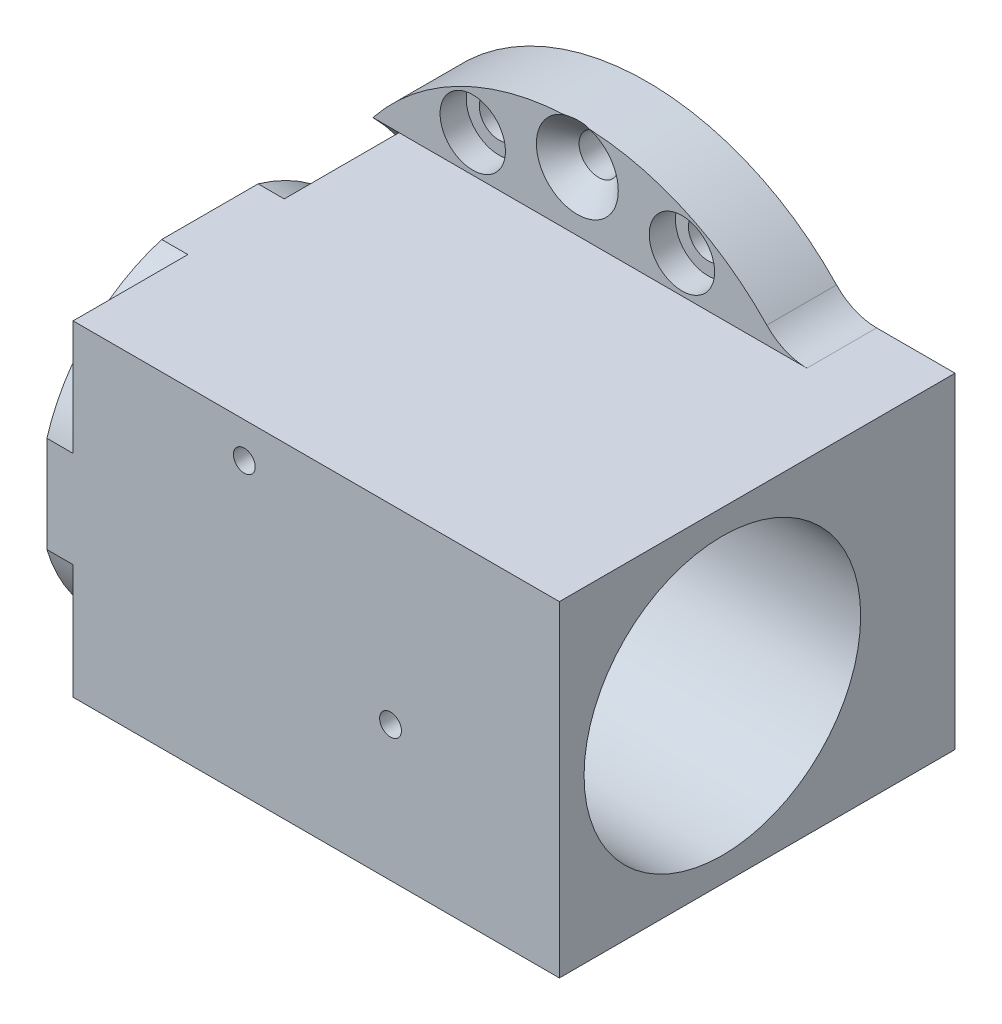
from build123d import *

# Parameters (mm, degrees)
BOSS_EXTRUDE1_DEPTH                                 = 8
CUT_EXTRUDE1_REACH                                  = 65.856
SKETCH4_W                                           = 55.8
SKETCH4_H                                           = 37.4
BOSS_EXTRUDE2_DEPTH                                 = 37.4
BOSS_EXTRUDE3_DEPTH                                 = 3
CUT_EXTRUDE2_START                                  = -3
CUT_EXTRUDE2_DEPTH                                  = 3
CUT_EXTRUDE3_START                                  = -3
CUT_EXTRUDE3_DEPTH                                  = 3
CSK_FOR_8_FLAT_HEAD_MACHINE_SCREW_100_D             = 4.5
CSK_FOR_8_FLAT_HEAD_MACHINE_SCREW_100_CSINK_D       = 9.4
CSK_FOR_8_FLAT_HEAD_MACHINE_SCREW_100_CSINK_ANGLE   = 90
F_4_CLEARANCE_HOLE1_D                               = 3.3
F_4_CLEARANCE_HOLE1_DEPTH                           = 6
CBORE_FOR_8_BINDING_HEAD_MACHINE_SCREW1_D           = 4.5
CBORE_FOR_8_BINDING_HEAD_MACHINE_SCREW1_CBORE_D     = 7.5
CBORE_FOR_8_BINDING_HEAD_MACHINE_SCREW1_CBORE_DEPTH = 3
F_2_CLEARANCE_HOLE1_D                               = 2.5
F_2_CLEARANCE_HOLE1_DEPTH                           = 6
F_2_CLEARANCE_HOLE2_REACH                           = 66.886
F_2_CLEARANCE_HOLE2_BORE_R                          = 1.25
FILLET1_R                                           = 6.35


with BuildPart() as part:
    # Sketch1 → Boss-Extrude1 (new body)
    with BuildSketch(Plane.XY.offset(8)):
        with BuildLine():
            Line((-23.45868709, 18.7), (-23.45868709, -18.7))
            ThreePointArc((-23.45868709, -18.7), (0, -30), (23.45868709, -18.7))
            Line((23.45868709, -18.7), (35.34131291, -18.7))
            Line((35.34131291, -18.7), (35.34131291, 18.7))
            Line((35.34131291, 18.7), (23.45868709, 18.7))
            ThreePointArc((23.45868709, 18.7), (0, 30), (-23.45868709, 18.7))
        make_face()
    extrude(amount=-BOSS_EXTRUDE1_DEPTH)

    # Sketch3 → Cut-Extrude1 (cut, up to next)
    with BuildSketch(Plane(origin=(-20.45868709, 0, 0), x_dir=(0, 0, -1), z_dir=(1, 0, 0)), mode=Mode.PRIVATE) as cut_extrude1_sk1:
        with BuildLine():
            Line((-8, 18.7), (-8, -18.7))
            ThreePointArc((-8, -18.7), (-0.254206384, 0), (-8, 18.7))
        make_face()
    cut_extrude1_tool1 = extrude(cut_extrude1_sk1.sketch, amount=-CUT_EXTRUDE1_REACH, mode=Mode.PRIVATE) & part.part
    add(cut_extrude1_tool1.solids().sort_by_distance((-20.458687, 0, 4.859168))[0], mode=Mode.SUBTRACT)

    # Sketch4 → Boss-Extrude2 (add)
    with BuildSketch(Plane.XY.offset(8)):
        with Locations((7.44131291, 0)):
            Rectangle(SKETCH4_W, SKETCH4_H)
    extrude(amount=BOSS_EXTRUDE2_DEPTH)

    # Sketch5 → Boss-Extrude3 (add)
    with BuildSketch(Plane.ZY.offset(20.45868709)):
        with BuildLine():
            Line((21.171890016, 18.7), (45.4, 18.7))
            Line((45.4, 18.7), (45.4, -18.7))
            Line((45.4, -18.7), (21.171890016, -18.7))
            ThreePointArc((21.171890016, -18.7), (7.2, 0), (21.171890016, 18.7))
        make_face()
    extrude(amount=BOSS_EXTRUDE3_DEPTH)

    # Sketch6 → Cut-Extrude2 (cut)
    with BuildSketch(Plane.ZY.offset(23.45868709).offset(CUT_EXTRUDE2_START)):
        with BuildLine():
            Line((45.4, -18.7), (45.4, -5.528109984))
            ThreePointArc((45.4, -5.528109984), (40.488582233, -13.788582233), (32.228109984, -18.7))
            Line((32.228109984, -18.7), (45.4, -18.7))
        make_face()
    extrude(amount=CUT_EXTRUDE2_DEPTH, mode=Mode.SUBTRACT)

    # Sketch7 → Cut-Extrude3 (cut)
    with BuildSketch(Plane.ZY.offset(23.45868709).offset(CUT_EXTRUDE3_START)):
        with BuildLine():
            Line((45.4, 18.7), (32.228109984, 18.7))
            ThreePointArc((32.228109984, 18.7), (40.488582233, 13.788582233), (45.4, 5.528109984))
            Line((45.4, 5.528109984), (45.4, 18.7))
        make_face()
    extrude(amount=CUT_EXTRUDE3_DEPTH, mode=Mode.SUBTRACT)

    # Sketch8 → Cut-Revolve1 (revolve, cut)
    with BuildSketch(Plane.XY.offset(26.7)):
        Polygon((-23.45868709, 15.86865), (-23.45868709, 0), (35.34131291, 0), (35.34131291, 15.86865), (9.94131291, 15.86865), (9.94131291, 13.5), (1.94131291, 13.5), (1.94131291, 15.86865), align=None)
    revolve(axis=Axis((-23.45868709, 0, 26.7), (1, 0, 0)), mode=Mode.SUBTRACT)

    # CSK for _8 Flat Head Machine Screw _100 (through all)
    with Locations(Plane.XY.offset(8)):
        with Locations((0, 25.5), (0, -25.5)):
            CounterSinkHole(CSK_FOR_8_FLAT_HEAD_MACHINE_SCREW_100_D / 2, CSK_FOR_8_FLAT_HEAD_MACHINE_SCREW_100_CSINK_D / 2, counter_sink_angle=CSK_FOR_8_FLAT_HEAD_MACHINE_SCREW_100_CSINK_ANGLE)

    # 4 Clearance Hole1
    with Locations(Plane(origin=(0, -18.7, 0), x_dir=(-1, 0, 0), z_dir=(0, -1, 0))):
        with Locations((12.45868709, -39.4), (-29.44131291, -39.4), (-29.44131291, -5.9)):
            Hole(F_4_CLEARANCE_HOLE1_D / 2, depth=F_4_CLEARANCE_HOLE1_DEPTH)

    # CBORE for _8 Binding Head Machine Screw1 (through all)
    with Locations(Plane.XY.offset(8)):
        with Locations((12, 22.95), (-12, 22.95), (-12, -22.95), (12, -22.95)):
            CounterBoreHole(CBORE_FOR_8_BINDING_HEAD_MACHINE_SCREW1_D / 2, CBORE_FOR_8_BINDING_HEAD_MACHINE_SCREW1_CBORE_D / 2, CBORE_FOR_8_BINDING_HEAD_MACHINE_SCREW1_CBORE_DEPTH)

    # 2 Clearance Hole1
    with Locations(Plane.XY.offset(45.4)):
        with Locations((-0.80868709, 14.63)):
            Hole(F_2_CLEARANCE_HOLE1_D / 2, depth=F_2_CLEARANCE_HOLE1_DEPTH)

    # 2 Clearance Hole2 bore → 2 Clearance Hole2 (cut, up to next)
    with BuildSketch(Plane.XY.offset(45.4), mode=Mode.PRIVATE) as f_2_clearance_hole2_sk1:
        with Locations((15.965146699, -3.2)):
            Circle(F_2_CLEARANCE_HOLE2_BORE_R)
    f_2_clearance_hole2_tool1 = extrude(f_2_clearance_hole2_sk1.sketch, amount=-F_2_CLEARANCE_HOLE2_REACH, mode=Mode.PRIVATE) & part.part
    add(f_2_clearance_hole2_tool1.solids().sort_by_distance((15.965147, -3.2, 45.4))[0], mode=Mode.SUBTRACT)

    # Fillet1
    fillet1_edges = [part.edges().sort_by_distance(p)[0] for p in [
        (23.45868709, 18.7, 4),
    ]]
    fillet(fillet1_edges, radius=FILLET1_R)


solid = part.part
